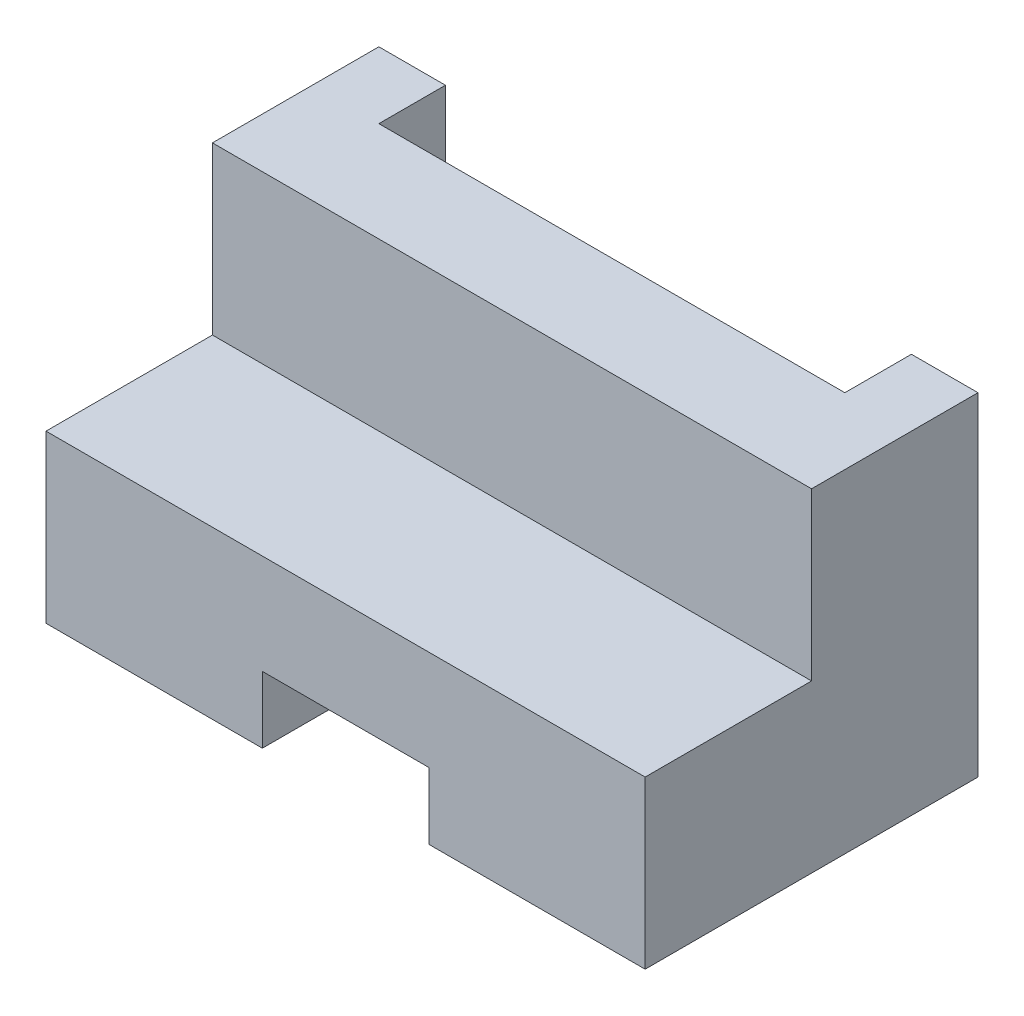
from build123d import *

# Parameters (mm, degrees)
SKETCH_1_W          = 90
SKETCH_1_H          = 50
EXTRUDE_1_DEPTH     = 25
SKETCH_2_W          = 90
SKETCH_2_H          = 25
EXTRUDE_2_DEPTH     = 25
SKETCH_3_W          = 70
SKETCH_3_H          = 10
CUT_EXTRUDE_1_DEPTH = 115.455231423
SKETCH_4_W          = 25
SKETCH_4_H          = 10
CUT_EXTRUDE_2_DEPTH = 115.455231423


with BuildPart() as part:
    # Sketch 1 → Extrude 1 (new body)
    with BuildSketch(Plane(origin=(0, 0, 0), x_dir=(1, 0, 0), z_dir=(0, 1, 0))):
        with Locations((45, 25)):
            Rectangle(SKETCH_1_W, SKETCH_1_H)
    extrude(amount=EXTRUDE_1_DEPTH)

    # Sketch 2 → Extrude 2 (add)
    with BuildSketch(Plane(origin=(0, 25, 0), x_dir=(1, 0, 0), z_dir=(0, 1, 0))):
        with Locations((45, 37.5)):
            Rectangle(SKETCH_2_W, SKETCH_2_H)
    extrude(amount=EXTRUDE_2_DEPTH)

    # Sketch 3 → Cut-Extrude 1 (cut, through all)
    with BuildSketch(Plane(origin=(0, 50, 0), x_dir=(1, 0, 0), z_dir=(0, 1, 0))):
        with Locations((45, 45)):
            Rectangle(SKETCH_3_W, SKETCH_3_H)
    extrude(amount=-CUT_EXTRUDE_1_DEPTH, mode=Mode.SUBTRACT)

    # Sketch 4 → Cut-Extrude 2 (cut, through all)
    with BuildSketch(Plane.XY):
        with Locations((45, 5)):
            Rectangle(SKETCH_4_W, SKETCH_4_H)
    extrude(amount=-CUT_EXTRUDE_2_DEPTH, mode=Mode.SUBTRACT)


solid = part.part
